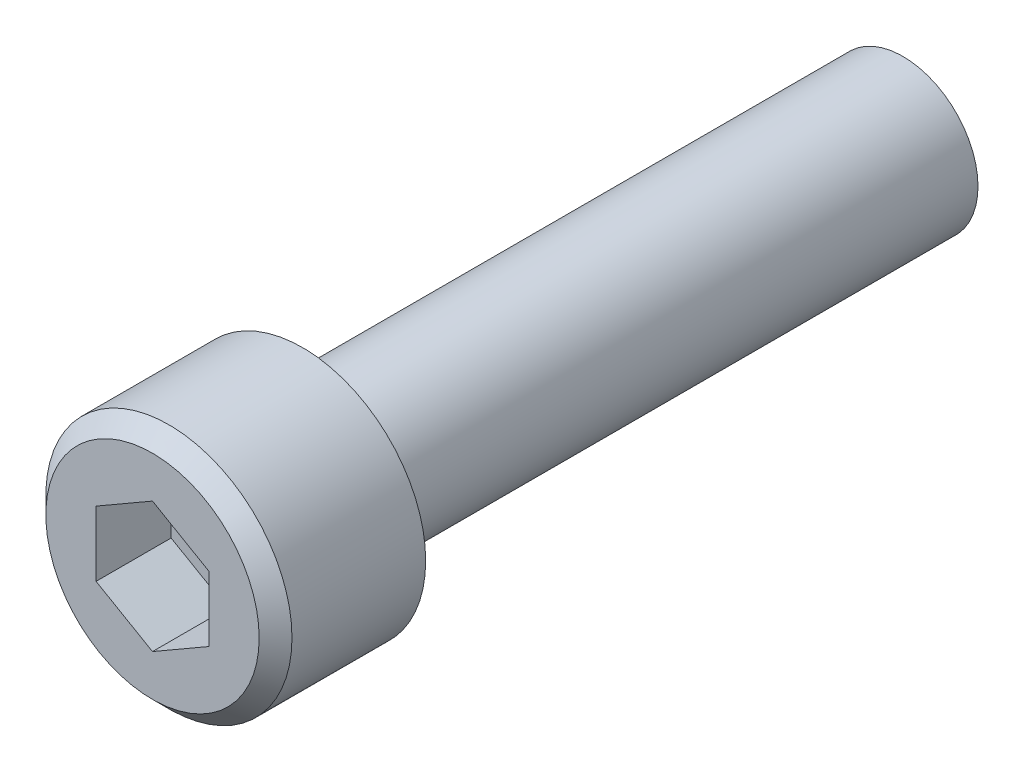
ISO-10303-21;
HEADER;
FILE_DESCRIPTION(('STEP AP214'),'2;1');
FILE_NAME('part.step','',(''),(''),'','','');
FILE_SCHEMA(('AUTOMOTIVE_DESIGN { 1 0 10303 214 1 1 1 1 }'));
ENDSEC;
DATA;
#1=APPLICATION_CONTEXT('core data for automotive mechanical design processes');
#2=APPLICATION_PROTOCOL_DEFINITION('international standard','automotive_design',2000,#1);
#3=PRODUCT_CONTEXT('',#1,'mechanical');
#4=PRODUCT('Part','Part','',(#3));
#5=PRODUCT_RELATED_PRODUCT_CATEGORY('part','',(#4));
#6=PRODUCT_DEFINITION_FORMATION('','',#4);
#7=PRODUCT_DEFINITION_CONTEXT('part definition',#1,'design');
#8=PRODUCT_DEFINITION('design','',#6,#7);
#9=PRODUCT_DEFINITION_SHAPE('','',#8);
#10=(LENGTH_UNIT() NAMED_UNIT(*) SI_UNIT(.MILLI.,.METRE.));
#11=(NAMED_UNIT(*) PLANE_ANGLE_UNIT() SI_UNIT($,.RADIAN.));
#12=(NAMED_UNIT(*) SI_UNIT($,.STERADIAN.) SOLID_ANGLE_UNIT());
#13=UNCERTAINTY_MEASURE_WITH_UNIT(LENGTH_MEASURE(1.E-05),#10,'distance_accuracy_value','');
#14=(GEOMETRIC_REPRESENTATION_CONTEXT(3) GLOBAL_UNCERTAINTY_ASSIGNED_CONTEXT((#13)) GLOBAL_UNIT_ASSIGNED_CONTEXT((#10,
#11,#12)) REPRESENTATION_CONTEXT('',''));
#15=CARTESIAN_POINT('',(0.,0.,0.));
#16=DIRECTION('',(0.,0.,1.));
#17=DIRECTION('',(1.,0.,0.));
#18=AXIS2_PLACEMENT_3D('',#15,#16,#17);
#19=CARTESIAN_POINT('',(0.,0.,12.7));
#20=DIRECTION('',(0.,0.,-1.));
#21=DIRECTION('',(-1.,0.,0.));
#22=AXIS2_PLACEMENT_3D('',#19,#20,#21);
#23=CYLINDRICAL_SURFACE('',#22,1.5875);
#24=CARTESIAN_POINT('',(0.,0.,12.446));
#25=DIRECTION('',(0.,0.,1.));
#26=DIRECTION('',(1.,0.,0.));
#27=AXIS2_PLACEMENT_3D('',#24,#25,#26);
#28=CIRCLE('',#27,1.5875);
#29=CARTESIAN_POINT('',(1.5875,0.,12.446));
#30=VERTEX_POINT('',#29);
#31=EDGE_CURVE('E147',#30,#30,#28,.F.);
#32=ORIENTED_EDGE('',*,*,#31,.T.);
#33=EDGE_LOOP('',(#32));
#34=FACE_BOUND('',#33,.T.);
#35=CARTESIAN_POINT('',(0.,0.,0.));
#36=DIRECTION('',(0.,0.,1.));
#37=DIRECTION('',(1.,0.,0.));
#38=AXIS2_PLACEMENT_3D('',#35,#36,#37);
#39=CIRCLE('',#38,1.5875);
#40=CARTESIAN_POINT('',(1.5875,0.,0.));
#41=VERTEX_POINT('',#40);
#42=EDGE_CURVE('E141',#41,#41,#39,.T.);
#43=ORIENTED_EDGE('',*,*,#42,.T.);
#44=EDGE_LOOP('',(#43));
#45=FACE_BOUND('',#44,.T.);
#46=ADVANCED_FACE('F34',(#34,#45),#23,.T.);
#47=CARTESIAN_POINT('',(0.,0.,0.));
#48=DIRECTION('',(0.,0.,1.));
#49=DIRECTION('',(1.,0.,0.));
#50=AXIS2_PLACEMENT_3D('',#47,#48,#49);
#51=PLANE('',#50);
#52=ORIENTED_EDGE('',*,*,#42,.F.);
#53=EDGE_LOOP('',(#52));
#54=FACE_BOUND('',#53,.T.);
#55=ADVANCED_FACE('F165',(#54),#51,.F.);
#56=CARTESIAN_POINT('',(0.,0.,12.7));
#57=DIRECTION('',(0.,0.,1.));
#58=DIRECTION('',(1.,0.,0.));
#59=AXIS2_PLACEMENT_3D('',#56,#57,#58);
#60=PLANE('',#59);
#61=CARTESIAN_POINT('',(0.,0.,12.7));
#62=DIRECTION('',(0.,0.,1.));
#63=DIRECTION('',(1.,0.,0.));
#64=AXIS2_PLACEMENT_3D('',#61,#62,#63);
#65=CIRCLE('',#64,1.8415);
#66=CARTESIAN_POINT('',(1.8415,0.,12.7));
#67=VERTEX_POINT('',#66);
#68=EDGE_CURVE('E144',#67,#67,#65,.T.);
#69=ORIENTED_EDGE('',*,*,#68,.T.);
#70=EDGE_LOOP('',(#69));
#71=FACE_BOUND('',#70,.T.);
#72=CARTESIAN_POINT('',(0.,0.,12.7));
#73=DIRECTION('',(0.,0.,1.));
#74=DIRECTION('',(1.,0.,0.));
#75=AXIS2_PLACEMENT_3D('',#72,#73,#74);
#76=CIRCLE('',#75,2.6035);
#77=CARTESIAN_POINT('',(2.6035,0.,12.7));
#78=VERTEX_POINT('',#77);
#79=EDGE_CURVE('E132',#78,#78,#76,.T.);
#80=ORIENTED_EDGE('',*,*,#79,.F.);
#81=EDGE_LOOP('',(#80));
#82=FACE_BOUND('',#81,.T.);
#83=ADVANCED_FACE('F170',(#71,#82),#60,.F.);
#84=CARTESIAN_POINT('',(0.,0.,15.875));
#85=DIRECTION('',(0.,0.,-1.));
#86=DIRECTION('',(-1.,0.,0.));
#87=AXIS2_PLACEMENT_3D('',#84,#85,#86);
#88=CYLINDRICAL_SURFACE('',#87,2.6035);
#89=CARTESIAN_POINT('',(0.,0.,15.5278666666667));
#90=DIRECTION('',(0.,0.,1.));
#91=DIRECTION('',(1.,0.,0.));
#92=AXIS2_PLACEMENT_3D('',#89,#90,#91);
#93=CIRCLE('',#92,2.6035);
#94=CARTESIAN_POINT('',(2.6035,0.,15.5278666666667));
#95=VERTEX_POINT('',#94);
#96=EDGE_CURVE('E11',#95,#95,#93,.F.);
#97=ORIENTED_EDGE('',*,*,#96,.T.);
#98=EDGE_LOOP('',(#97));
#99=FACE_BOUND('',#98,.T.);
#100=ORIENTED_EDGE('',*,*,#79,.T.);
#101=EDGE_LOOP('',(#100));
#102=FACE_BOUND('',#101,.T.);
#103=ADVANCED_FACE('F185',(#99,#102),#88,.T.);
#104=CARTESIAN_POINT('',(0.,0.,15.875));
#105=DIRECTION('',(0.,0.,1.));
#106=DIRECTION('',(1.,0.,0.));
#107=AXIS2_PLACEMENT_3D('',#104,#105,#106);
#108=PLANE('',#107);
#109=CARTESIAN_POINT('',(0.,0.,15.875));
#110=DIRECTION('',(0.,0.,1.));
#111=DIRECTION('',(1.,0.,0.));
#112=AXIS2_PLACEMENT_3D('',#109,#110,#111);
#113=CIRCLE('',#112,2.25636666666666);
#114=CARTESIAN_POINT('',(2.25636666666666,0.,15.875));
#115=VERTEX_POINT('',#114);
#116=EDGE_CURVE('E41',#115,#115,#113,.T.);
#117=ORIENTED_EDGE('',*,*,#116,.T.);
#118=EDGE_LOOP('',(#117));
#119=FACE_BOUND('',#118,.T.);
#120=DIRECTION('',(-0.866025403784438,-0.500000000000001,0.));
#121=VECTOR('',#120,1.);
#122=CARTESIAN_POINT('',(0.,1.37848150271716,15.8750000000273));
#123=LINE('',#122,#121);
#124=CARTESIAN_POINT('',(0.,1.37848150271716,15.8750000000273));
#125=VERTEX_POINT('',#124);
#126=CARTESIAN_POINT('',(-1.1938,0.689240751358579,15.875));
#127=VERTEX_POINT('',#126);
#128=EDGE_CURVE('E48',#125,#127,#123,.T.);
#129=ORIENTED_EDGE('',*,*,#128,.F.);
#130=DIRECTION('',(0.866025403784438,-0.500000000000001,0.));
#131=VECTOR('',#130,1.);
#132=CARTESIAN_POINT('',(0.,1.37848150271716,15.8750000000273));
#133=LINE('',#132,#131);
#134=CARTESIAN_POINT('',(1.1938,0.689240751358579,15.8750000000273));
#135=VERTEX_POINT('',#134);
#136=EDGE_CURVE('E115',#125,#135,#133,.T.);
#137=ORIENTED_EDGE('',*,*,#136,.T.);
#138=DIRECTION('',(0.,-1.,0.));
#139=VECTOR('',#138,1.);
#140=CARTESIAN_POINT('',(1.1938,0.689240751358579,15.8750000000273));
#141=LINE('',#140,#139);
#142=CARTESIAN_POINT('',(1.1938,-0.689240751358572,15.8750000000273));
#143=VERTEX_POINT('',#142);
#144=EDGE_CURVE('E110',#135,#143,#141,.T.);
#145=ORIENTED_EDGE('',*,*,#144,.T.);
#146=DIRECTION('',(0.86602540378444,0.499999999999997,0.));
#147=VECTOR('',#146,1.);
#148=CARTESIAN_POINT('',(0.,-1.37848150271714,15.8750000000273));
#149=LINE('',#148,#147);
#150=CARTESIAN_POINT('',(0.,-1.37848150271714,15.8750000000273));
#151=VERTEX_POINT('',#150);
#152=EDGE_CURVE('E108',#151,#143,#149,.T.);
#153=ORIENTED_EDGE('',*,*,#152,.F.);
#154=DIRECTION('',(-0.86602540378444,0.499999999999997,0.));
#155=VECTOR('',#154,1.);
#156=CARTESIAN_POINT('',(0.,-1.37848150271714,15.8750000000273));
#157=LINE('',#156,#155);
#158=CARTESIAN_POINT('',(-1.1938,-0.689240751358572,15.8750000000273));
#159=VERTEX_POINT('',#158);
#160=EDGE_CURVE('E90',#151,#159,#157,.T.);
#161=ORIENTED_EDGE('',*,*,#160,.T.);
#162=DIRECTION('',(0.,-1.,0.));
#163=VECTOR('',#162,1.);
#164=CARTESIAN_POINT('',(-1.1938,0.689240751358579,15.8750000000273));
#165=LINE('',#164,#163);
#166=EDGE_CURVE('E101',#127,#159,#165,.T.);
#167=ORIENTED_EDGE('',*,*,#166,.F.);
#168=EDGE_LOOP('',(#129,#137,#145,#153,#161,#167));
#169=FACE_BOUND('',#168,.T.);
#170=ADVANCED_FACE('F105',(#119,#169),#108,.T.);
#171=CARTESIAN_POINT('',(0.,0.,12.446));
#172=DIRECTION('',(0.,0.,1.));
#173=DIRECTION('',(1.,0.,0.));
#174=AXIS2_PLACEMENT_3D('',#171,#172,#173);
#175=TOROIDAL_SURFACE('',#174,1.8415,0.254);
#176=ORIENTED_EDGE('',*,*,#31,.F.);
#177=EDGE_LOOP('',(#176));
#178=FACE_BOUND('',#177,.T.);
#179=ORIENTED_EDGE('',*,*,#68,.F.);
#180=EDGE_LOOP('',(#179));
#181=FACE_BOUND('',#180,.T.);
#182=ADVANCED_FACE('F176',(#178,#181),#175,.F.);
#183=CARTESIAN_POINT('',(0.,1.37848150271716,14.2875000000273));
#184=DIRECTION('',(-0.500000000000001,0.866025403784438,0.));
#185=DIRECTION('',(-0.866025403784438,-0.500000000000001,0.));
#186=AXIS2_PLACEMENT_3D('',#183,#184,#185);
#187=PLANE('',#186);
#188=ORIENTED_EDGE('',*,*,#128,.T.);
#189=DIRECTION('',(0.,0.,1.));
#190=VECTOR('',#189,1.);
#191=CARTESIAN_POINT('',(-1.1938,0.689240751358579,14.2875000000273));
#192=LINE('',#191,#190);
#193=CARTESIAN_POINT('',(-1.1938,0.689240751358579,14.2875000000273));
#194=VERTEX_POINT('',#193);
#195=EDGE_CURVE('E98',#194,#127,#192,.T.);
#196=ORIENTED_EDGE('',*,*,#195,.F.);
#197=DIRECTION('',(-0.866025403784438,-0.500000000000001,0.));
#198=VECTOR('',#197,1.);
#199=CARTESIAN_POINT('',(0.,1.37848150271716,14.2875000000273));
#200=LINE('',#199,#198);
#201=CARTESIAN_POINT('',(0.,1.37848150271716,14.2875000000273));
#202=VERTEX_POINT('',#201);
#203=EDGE_CURVE('E118',#202,#194,#200,.T.);
#204=ORIENTED_EDGE('',*,*,#203,.F.);
#205=DIRECTION('',(0.,0.,1.));
#206=VECTOR('',#205,1.);
#207=CARTESIAN_POINT('',(0.,1.37848150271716,14.2875000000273));
#208=LINE('',#207,#206);
#209=EDGE_CURVE('E55',#202,#125,#208,.T.);
#210=ORIENTED_EDGE('',*,*,#209,.T.);
#211=EDGE_LOOP('',(#188,#196,#204,#210));
#212=FACE_BOUND('',#211,.T.);
#213=ADVANCED_FACE('F179',(#212),#187,.F.);
#214=CARTESIAN_POINT('',(0.,1.37848150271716,14.2875000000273));
#215=DIRECTION('',(-0.500000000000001,-0.866025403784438,0.));
#216=DIRECTION('',(0.866025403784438,-0.500000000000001,0.));
#217=AXIS2_PLACEMENT_3D('',#214,#215,#216);
#218=PLANE('',#217);
#219=ORIENTED_EDGE('',*,*,#136,.F.);
#220=ORIENTED_EDGE('',*,*,#209,.F.);
#221=DIRECTION('',(0.866025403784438,-0.500000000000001,0.));
#222=VECTOR('',#221,1.);
#223=CARTESIAN_POINT('',(0.,1.37848150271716,14.2875000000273));
#224=LINE('',#223,#222);
#225=CARTESIAN_POINT('',(1.1938,0.689240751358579,14.2875000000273));
#226=VERTEX_POINT('',#225);
#227=EDGE_CURVE('E129',#202,#226,#224,.T.);
#228=ORIENTED_EDGE('',*,*,#227,.T.);
#229=DIRECTION('',(0.,0.,1.));
#230=VECTOR('',#229,1.);
#231=CARTESIAN_POINT('',(1.1938,0.689240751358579,14.2875000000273));
#232=LINE('',#231,#230);
#233=EDGE_CURVE('E133',#226,#135,#232,.T.);
#234=ORIENTED_EDGE('',*,*,#233,.T.);
#235=EDGE_LOOP('',(#219,#220,#228,#234));
#236=FACE_BOUND('',#235,.T.);
#237=ADVANCED_FACE('F199',(#236),#218,.T.);
#238=CARTESIAN_POINT('',(1.1938,0.689240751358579,14.2875000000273));
#239=DIRECTION('',(-1.,0.,0.));
#240=DIRECTION('',(0.,0.,1.));
#241=AXIS2_PLACEMENT_3D('',#238,#239,#240);
#242=PLANE('',#241);
#243=ORIENTED_EDGE('',*,*,#144,.F.);
#244=ORIENTED_EDGE('',*,*,#233,.F.);
#245=DIRECTION('',(0.,-1.,0.));
#246=VECTOR('',#245,1.);
#247=CARTESIAN_POINT('',(1.1938,0.689240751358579,14.2875000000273));
#248=LINE('',#247,#246);
#249=CARTESIAN_POINT('',(1.1938,-0.689240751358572,14.2875000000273));
#250=VERTEX_POINT('',#249);
#251=EDGE_CURVE('E127',#226,#250,#248,.T.);
#252=ORIENTED_EDGE('',*,*,#251,.T.);
#253=DIRECTION('',(0.,0.,1.));
#254=VECTOR('',#253,1.);
#255=CARTESIAN_POINT('',(1.1938,-0.689240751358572,14.2875000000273));
#256=LINE('',#255,#254);
#257=EDGE_CURVE('E135',#250,#143,#256,.T.);
#258=ORIENTED_EDGE('',*,*,#257,.T.);
#259=EDGE_LOOP('',(#243,#244,#252,#258));
#260=FACE_BOUND('',#259,.T.);
#261=ADVANCED_FACE('F207',(#260),#242,.T.);
#262=CARTESIAN_POINT('',(0.,-1.37848150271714,14.2875000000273));
#263=DIRECTION('',(0.499999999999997,-0.86602540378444,0.));
#264=DIRECTION('',(0.86602540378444,0.499999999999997,0.));
#265=AXIS2_PLACEMENT_3D('',#262,#263,#264);
#266=PLANE('',#265);
#267=ORIENTED_EDGE('',*,*,#152,.T.);
#268=ORIENTED_EDGE('',*,*,#257,.F.);
#269=DIRECTION('',(0.86602540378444,0.499999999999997,0.));
#270=VECTOR('',#269,1.);
#271=CARTESIAN_POINT('',(0.,-1.37848150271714,14.2875000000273));
#272=LINE('',#271,#270);
#273=CARTESIAN_POINT('',(0.,-1.37848150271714,14.2875000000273));
#274=VERTEX_POINT('',#273);
#275=EDGE_CURVE('E124',#274,#250,#272,.T.);
#276=ORIENTED_EDGE('',*,*,#275,.F.);
#277=DIRECTION('',(0.,0.,1.));
#278=VECTOR('',#277,1.);
#279=CARTESIAN_POINT('',(0.,-1.37848150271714,14.2875000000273));
#280=LINE('',#279,#278);
#281=EDGE_CURVE('E97',#274,#151,#280,.T.);
#282=ORIENTED_EDGE('',*,*,#281,.T.);
#283=EDGE_LOOP('',(#267,#268,#276,#282));
#284=FACE_BOUND('',#283,.T.);
#285=ADVANCED_FACE('F204',(#284),#266,.F.);
#286=CARTESIAN_POINT('',(0.,-1.37848150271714,14.2875000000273));
#287=DIRECTION('',(0.499999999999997,0.86602540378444,0.));
#288=DIRECTION('',(-0.86602540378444,0.499999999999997,0.));
#289=AXIS2_PLACEMENT_3D('',#286,#287,#288);
#290=PLANE('',#289);
#291=ORIENTED_EDGE('',*,*,#160,.F.);
#292=ORIENTED_EDGE('',*,*,#281,.F.);
#293=DIRECTION('',(-0.86602540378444,0.499999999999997,0.));
#294=VECTOR('',#293,1.);
#295=CARTESIAN_POINT('',(0.,-1.37848150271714,14.2875000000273));
#296=LINE('',#295,#294);
#297=CARTESIAN_POINT('',(-1.1938,-0.689240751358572,14.2875000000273));
#298=VERTEX_POINT('',#297);
#299=EDGE_CURVE('E93',#274,#298,#296,.T.);
#300=ORIENTED_EDGE('',*,*,#299,.T.);
#301=DIRECTION('',(0.,0.,1.));
#302=VECTOR('',#301,1.);
#303=CARTESIAN_POINT('',(-1.1938,-0.689240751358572,14.2875000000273));
#304=LINE('',#303,#302);
#305=EDGE_CURVE('E86',#298,#159,#304,.T.);
#306=ORIENTED_EDGE('',*,*,#305,.T.);
#307=EDGE_LOOP('',(#291,#292,#300,#306));
#308=FACE_BOUND('',#307,.T.);
#309=ADVANCED_FACE('F88',(#308),#290,.T.);
#310=CARTESIAN_POINT('',(-1.1938,0.689240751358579,14.2875000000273));
#311=DIRECTION('',(-1.,0.,0.));
#312=DIRECTION('',(0.,0.,1.));
#313=AXIS2_PLACEMENT_3D('',#310,#311,#312);
#314=PLANE('',#313);
#315=ORIENTED_EDGE('',*,*,#166,.T.);
#316=ORIENTED_EDGE('',*,*,#305,.F.);
#317=DIRECTION('',(0.,-1.,0.));
#318=VECTOR('',#317,1.);
#319=CARTESIAN_POINT('',(-1.1938,0.689240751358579,14.2875000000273));
#320=LINE('',#319,#318);
#321=EDGE_CURVE('E121',#194,#298,#320,.T.);
#322=ORIENTED_EDGE('',*,*,#321,.F.);
#323=ORIENTED_EDGE('',*,*,#195,.T.);
#324=EDGE_LOOP('',(#315,#316,#322,#323));
#325=FACE_BOUND('',#324,.T.);
#326=ADVANCED_FACE('F102',(#325),#314,.F.);
#327=CARTESIAN_POINT('',(0.,1.37848150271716,14.2875000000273));
#328=DIRECTION('',(0.,0.,1.));
#329=DIRECTION('',(1.,0.,0.));
#330=AXIS2_PLACEMENT_3D('',#327,#328,#329);
#331=PLANE('',#330);
#332=ORIENTED_EDGE('',*,*,#203,.T.);
#333=ORIENTED_EDGE('',*,*,#321,.T.);
#334=ORIENTED_EDGE('',*,*,#299,.F.);
#335=ORIENTED_EDGE('',*,*,#275,.T.);
#336=ORIENTED_EDGE('',*,*,#251,.F.);
#337=ORIENTED_EDGE('',*,*,#227,.F.);
#338=EDGE_LOOP('',(#332,#333,#334,#335,#336,#337));
#339=FACE_BOUND('',#338,.T.);
#340=ADVANCED_FACE('F155',(#339),#331,.T.);
#341=CARTESIAN_POINT('',(0.,0.,15.875));
#342=DIRECTION('',(0.,0.,-1.));
#343=DIRECTION('',(-1.,0.,0.));
#344=AXIS2_PLACEMENT_3D('',#341,#342,#343);
#345=CONICAL_SURFACE('',#344,2.25636666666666,0.785398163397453);
#346=ORIENTED_EDGE('',*,*,#96,.F.);
#347=EDGE_LOOP('',(#346));
#348=FACE_BOUND('',#347,.T.);
#349=ORIENTED_EDGE('',*,*,#116,.F.);
#350=EDGE_LOOP('',(#349));
#351=FACE_BOUND('',#350,.T.);
#352=ADVANCED_FACE('F153',(#348,#351),#345,.T.);
#353=CLOSED_SHELL('',(#46,#55,#83,#103,#170,#182,#213,#237,#261,#285,#309,#326,#340,#352));
#354=MANIFOLD_SOLID_BREP('B2',#353);
#355=ADVANCED_BREP_SHAPE_REPRESENTATION('',(#18,#354),#14);
#356=SHAPE_DEFINITION_REPRESENTATION(#9,#355);
ENDSEC;
END-ISO-10303-21;
